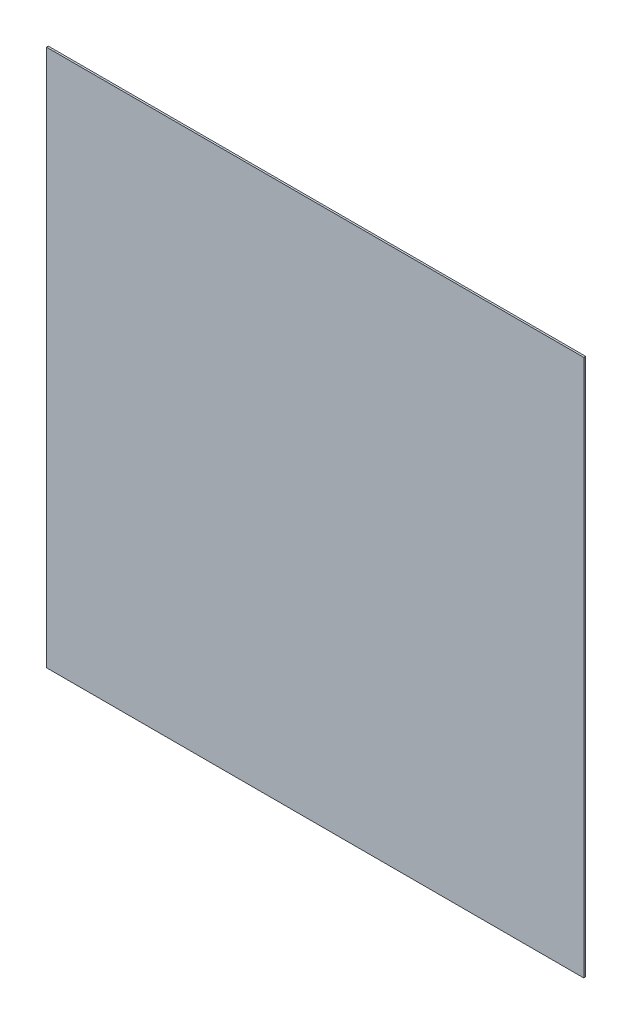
from build123d import *

# Parameters (mm, degrees)
SKETCH1_W          = 457.2
SKETCH1_H          = 457.2
BASE_EXTRUDE_DEPTH = 1.5875


with BuildPart() as part:
    # Sketch1 → Base-Extrude (new body)
    with BuildSketch(Plane.XY):
        with Locations((228.6, 228.6)):
            Rectangle(SKETCH1_W, SKETCH1_H)
    extrude(amount=BASE_EXTRUDE_DEPTH)


solid = part.part
